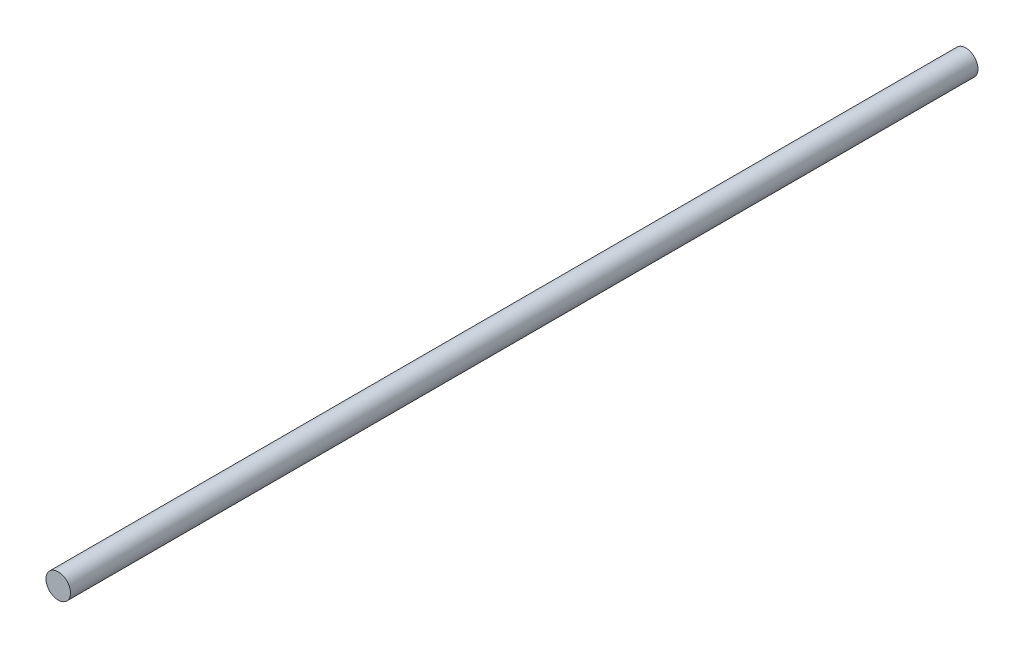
from build123d import *

# Parameters (mm, degrees)
ESQUISSE1_R        = 5
BOSS_EXTRU_1_DEPTH = 370


with BuildPart() as part:
    # Esquisse1 → Boss.-Extru.1 (new body)
    with BuildSketch(Plane.XY):
        Circle(ESQUISSE1_R)
    extrude(amount=BOSS_EXTRU_1_DEPTH)


solid = part.part
